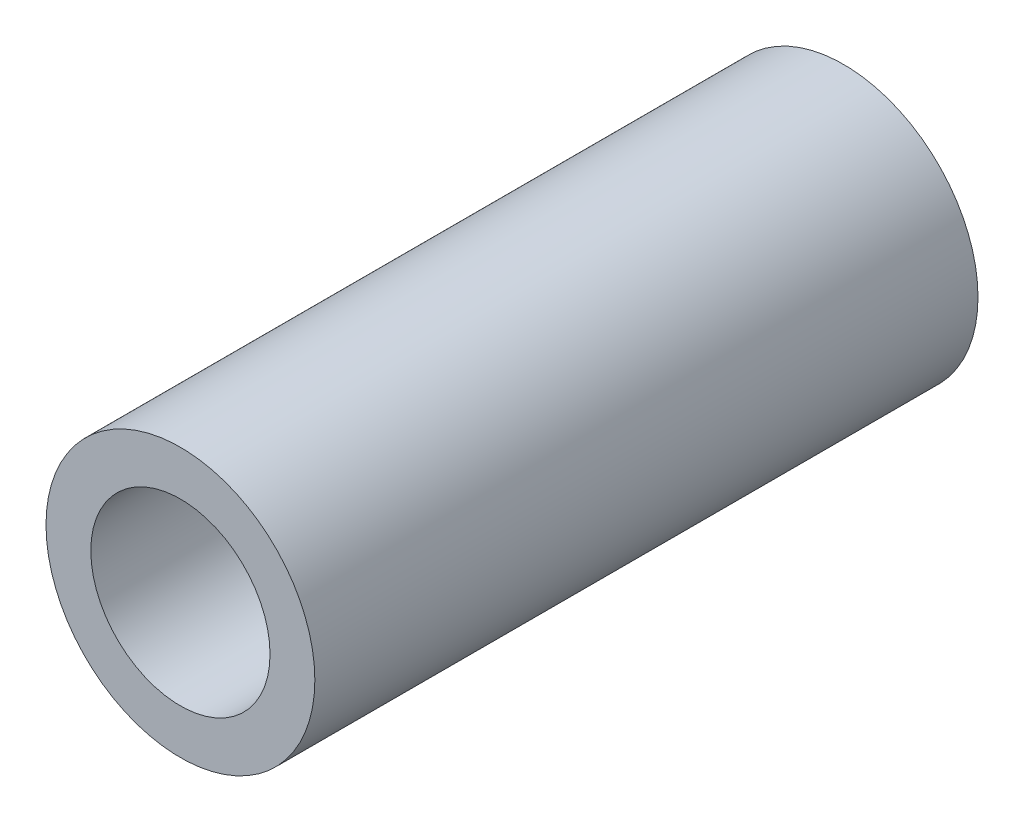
from build123d import *

# Parameters (mm, degrees)
SKETCH_1_R      = 3
SKETCH_1_R_2    = 2
EXTRUDE_1_DEPTH = 14.8


with BuildPart() as part:
    # Sketch 1 → Extrude 1 (new body)
    with BuildSketch(Plane.XY):
        Circle(SKETCH_1_R)
        Circle(SKETCH_1_R_2, mode=Mode.SUBTRACT)
    extrude(amount=EXTRUDE_1_DEPTH)


solid = part.part
